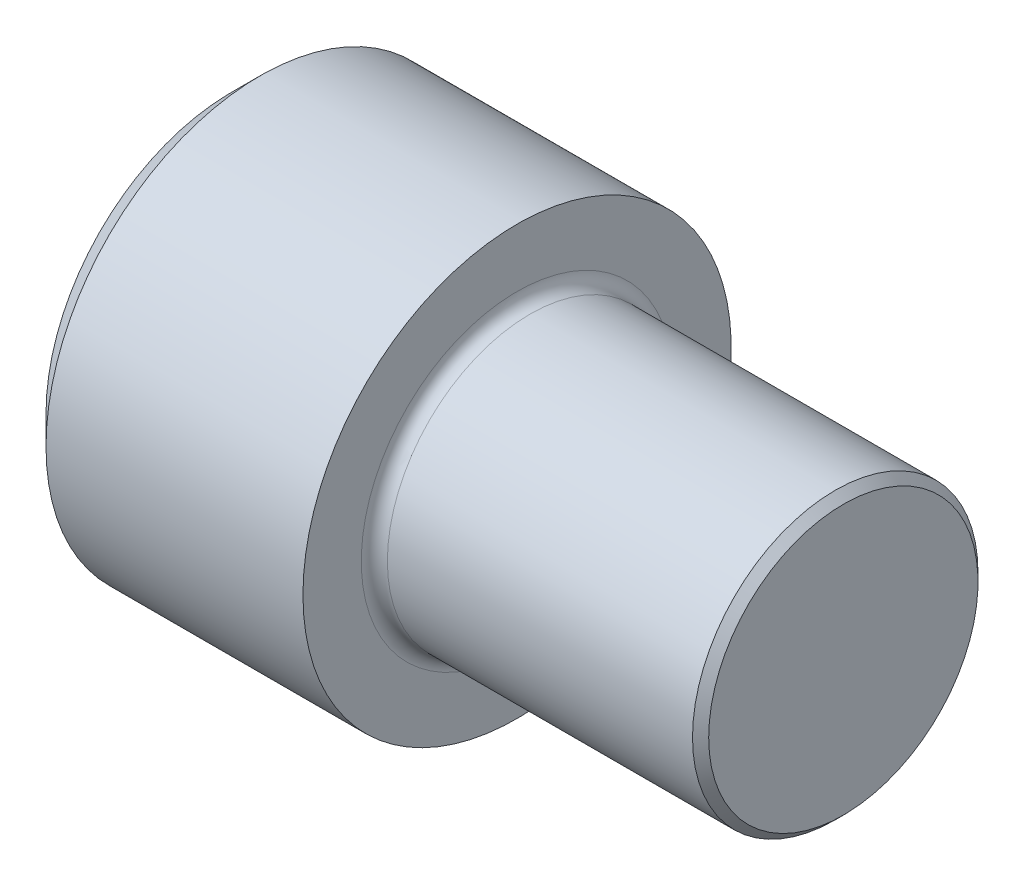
ISO-10303-21;
HEADER;
FILE_DESCRIPTION(('STEP AP214'),'2;1');
FILE_NAME('part.step','',(''),(''),'','','');
FILE_SCHEMA(('AUTOMOTIVE_DESIGN { 1 0 10303 214 1 1 1 1 }'));
ENDSEC;
DATA;
#1=APPLICATION_CONTEXT('core data for automotive mechanical design processes');
#2=APPLICATION_PROTOCOL_DEFINITION('international standard','automotive_design',2000,#1);
#3=PRODUCT_CONTEXT('',#1,'mechanical');
#4=PRODUCT('Part','Part','',(#3));
#5=PRODUCT_RELATED_PRODUCT_CATEGORY('part','',(#4));
#6=PRODUCT_DEFINITION_FORMATION('','',#4);
#7=PRODUCT_DEFINITION_CONTEXT('part definition',#1,'design');
#8=PRODUCT_DEFINITION('design','',#6,#7);
#9=PRODUCT_DEFINITION_SHAPE('','',#8);
#10=(LENGTH_UNIT() NAMED_UNIT(*) SI_UNIT(.MILLI.,.METRE.));
#11=(NAMED_UNIT(*) PLANE_ANGLE_UNIT() SI_UNIT($,.RADIAN.));
#12=(NAMED_UNIT(*) SI_UNIT($,.STERADIAN.) SOLID_ANGLE_UNIT());
#13=UNCERTAINTY_MEASURE_WITH_UNIT(LENGTH_MEASURE(1.E-05),#10,'distance_accuracy_value','');
#14=(GEOMETRIC_REPRESENTATION_CONTEXT(3) GLOBAL_UNCERTAINTY_ASSIGNED_CONTEXT((#13)) GLOBAL_UNIT_ASSIGNED_CONTEXT((#10,
#11,#12)) REPRESENTATION_CONTEXT('',''));
#15=CARTESIAN_POINT('',(0.,0.,0.));
#16=DIRECTION('',(0.,0.,1.));
#17=DIRECTION('',(1.,0.,0.));
#18=AXIS2_PLACEMENT_3D('',#15,#16,#17);
#19=CARTESIAN_POINT('',(0.,0.,0.));
#20=DIRECTION('',(-1.,0.,0.));
#21=DIRECTION('',(0.,0.,1.));
#22=AXIS2_PLACEMENT_3D('',#19,#20,#21);
#23=PLANE('',#22);
#24=DIRECTION('',(0.,-0.499999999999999,0.866025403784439));
#25=VECTOR('',#24,1.);
#26=CARTESIAN_POINT('',(0.,18.3308710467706,0.));
#27=LINE('',#26,#25);
#28=CARTESIAN_POINT('',(0.,18.3308710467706,0.));
#29=VERTEX_POINT('',#28);
#30=CARTESIAN_POINT('',(0.,9.16543552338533,15.875));
#31=VERTEX_POINT('',#30);
#32=EDGE_CURVE('E264',#29,#31,#27,.T.);
#33=ORIENTED_EDGE('',*,*,#32,.T.);
#34=DIRECTION('',(0.,1.,0.));
#35=VECTOR('',#34,1.);
#36=CARTESIAN_POINT('',(0.,-9.16543552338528,15.875));
#37=LINE('',#36,#35);
#38=CARTESIAN_POINT('',(0.,-9.16543552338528,15.875));
#39=VERTEX_POINT('',#38);
#40=EDGE_CURVE('E132',#39,#31,#37,.T.);
#41=ORIENTED_EDGE('',*,*,#40,.F.);
#42=DIRECTION('',(0.,-0.500000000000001,-0.866025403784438));
#43=VECTOR('',#42,1.);
#44=CARTESIAN_POINT('',(0.,-9.16543552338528,15.875));
#45=LINE('',#44,#43);
#46=CARTESIAN_POINT('',(0.,-18.3308710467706,0.));
#47=VERTEX_POINT('',#46);
#48=EDGE_CURVE('E269',#39,#47,#45,.T.);
#49=ORIENTED_EDGE('',*,*,#48,.T.);
#50=DIRECTION('',(0.,0.499999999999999,-0.86602540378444));
#51=VECTOR('',#50,1.);
#52=CARTESIAN_POINT('',(0.,-18.3308710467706,0.));
#53=LINE('',#52,#51);
#54=CARTESIAN_POINT('',(0.,-9.16543552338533,-15.875));
#55=VERTEX_POINT('',#54);
#56=EDGE_CURVE('E266',#47,#55,#53,.T.);
#57=ORIENTED_EDGE('',*,*,#56,.T.);
#58=DIRECTION('',(0.,-1.,0.));
#59=VECTOR('',#58,1.);
#60=CARTESIAN_POINT('',(0.,9.16543552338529,-15.875));
#61=LINE('',#60,#59);
#62=CARTESIAN_POINT('',(0.,9.16543552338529,-15.875));
#63=VERTEX_POINT('',#62);
#64=EDGE_CURVE('E271',#63,#55,#61,.T.);
#65=ORIENTED_EDGE('',*,*,#64,.F.);
#66=DIRECTION('',(0.,-0.500000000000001,-0.866025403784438));
#67=VECTOR('',#66,1.);
#68=CARTESIAN_POINT('',(0.,18.3308710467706,0.));
#69=LINE('',#68,#67);
#70=EDGE_CURVE('E128',#29,#63,#69,.T.);
#71=ORIENTED_EDGE('',*,*,#70,.F.);
#72=EDGE_LOOP('',(#33,#41,#49,#57,#65,#71));
#73=FACE_BOUND('',#72,.T.);
#74=CARTESIAN_POINT('',(0.,0.,0.));
#75=DIRECTION('',(-1.,0.,0.));
#76=DIRECTION('',(0.,0.,1.));
#77=AXIS2_PLACEMENT_3D('',#74,#75,#76);
#78=CIRCLE('',#77,28.8925);
#79=CARTESIAN_POINT('',(0.,0.,28.8925));
#80=VERTEX_POINT('',#79);
#81=EDGE_CURVE('E160',#80,#80,#78,.T.);
#82=ORIENTED_EDGE('',*,*,#81,.T.);
#83=EDGE_LOOP('',(#82));
#84=FACE_BOUND('',#83,.T.);
#85=ADVANCED_FACE('F39',(#73,#84),#23,.T.);
#86=CARTESIAN_POINT('',(0.,0.,0.));
#87=DIRECTION('',(1.,0.,0.));
#88=DIRECTION('',(0.,0.,-1.));
#89=AXIS2_PLACEMENT_3D('',#86,#87,#88);
#90=CONICAL_SURFACE('',#89,28.8925,0.785398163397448);
#91=CARTESIAN_POINT('',(4.44499999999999,0.,0.));
#92=DIRECTION('',(-1.,0.,0.));
#93=DIRECTION('',(0.,0.,1.));
#94=AXIS2_PLACEMENT_3D('',#91,#92,#93);
#95=CIRCLE('',#94,33.3375);
#96=CARTESIAN_POINT('',(4.44499999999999,0.,33.3375));
#97=VERTEX_POINT('',#96);
#98=EDGE_CURVE('E158',#97,#97,#95,.T.);
#99=ORIENTED_EDGE('',*,*,#98,.T.);
#100=EDGE_LOOP('',(#99));
#101=FACE_BOUND('',#100,.T.);
#102=ORIENTED_EDGE('',*,*,#81,.F.);
#103=EDGE_LOOP('',(#102));
#104=FACE_BOUND('',#103,.T.);
#105=ADVANCED_FACE('F181',(#101,#104),#90,.T.);
#106=CARTESIAN_POINT('',(-31.75,0.,0.));
#107=DIRECTION('',(-1.,0.,0.));
#108=DIRECTION('',(0.,0.,1.));
#109=AXIS2_PLACEMENT_3D('',#106,#107,#108);
#110=CYLINDRICAL_SURFACE('',#109,33.3375);
#111=CARTESIAN_POINT('',(44.45,0.,0.));
#112=DIRECTION('',(-1.,0.,0.));
#113=DIRECTION('',(0.,0.,1.));
#114=AXIS2_PLACEMENT_3D('',#111,#112,#113);
#115=CIRCLE('',#114,33.3375);
#116=CARTESIAN_POINT('',(44.45,0.,33.3375));
#117=VERTEX_POINT('',#116);
#118=EDGE_CURVE('E151',#117,#117,#115,.T.);
#119=ORIENTED_EDGE('',*,*,#118,.T.);
#120=EDGE_LOOP('',(#119));
#121=FACE_BOUND('',#120,.T.);
#122=ORIENTED_EDGE('',*,*,#98,.F.);
#123=EDGE_LOOP('',(#122));
#124=FACE_BOUND('',#123,.T.);
#125=ADVANCED_FACE('F187',(#121,#124),#110,.T.);
#126=CARTESIAN_POINT('',(44.45,33.3375,0.));
#127=DIRECTION('',(1.,0.,0.));
#128=DIRECTION('',(0.,0.,-1.));
#129=AXIS2_PLACEMENT_3D('',#126,#127,#128);
#130=PLANE('',#129);
#131=CARTESIAN_POINT('',(44.45,0.,0.));
#132=DIRECTION('',(1.,0.,0.));
#133=DIRECTION('',(0.,0.,-1.));
#134=AXIS2_PLACEMENT_3D('',#131,#132,#133);
#135=CIRCLE('',#134,24.2570000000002);
#136=CARTESIAN_POINT('',(44.45,0.,-24.2570000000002));
#137=VERTEX_POINT('',#136);
#138=EDGE_CURVE('E50',#137,#137,#135,.F.);
#139=ORIENTED_EDGE('',*,*,#138,.T.);
#140=EDGE_LOOP('',(#139));
#141=FACE_BOUND('',#140,.T.);
#142=ORIENTED_EDGE('',*,*,#118,.F.);
#143=EDGE_LOOP('',(#142));
#144=FACE_BOUND('',#143,.T.);
#145=ADVANCED_FACE('F165',(#141,#144),#130,.T.);
#146=CARTESIAN_POINT('',(-31.75,0.,0.));
#147=DIRECTION('',(-1.,0.,0.));
#148=DIRECTION('',(0.,0.,1.));
#149=AXIS2_PLACEMENT_3D('',#146,#147,#148);
#150=CYLINDRICAL_SURFACE('',#149,22.2250000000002);
#151=CARTESIAN_POINT('',(46.482,0.,0.));
#152=DIRECTION('',(1.,0.,0.));
#153=DIRECTION('',(0.,0.,-1.));
#154=AXIS2_PLACEMENT_3D('',#151,#152,#153);
#155=CIRCLE('',#154,22.2250000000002);
#156=CARTESIAN_POINT('',(46.482,0.,-22.2250000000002));
#157=VERTEX_POINT('',#156);
#158=EDGE_CURVE('E11',#157,#157,#155,.T.);
#159=ORIENTED_EDGE('',*,*,#158,.T.);
#160=EDGE_LOOP('',(#159));
#161=FACE_BOUND('',#160,.T.);
#162=CARTESIAN_POINT('',(93.9901600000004,0.,0.));
#163=DIRECTION('',(-1.,0.,0.));
#164=DIRECTION('',(0.,0.,1.));
#165=AXIS2_PLACEMENT_3D('',#162,#163,#164);
#166=CIRCLE('',#165,22.2250000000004);
#167=CARTESIAN_POINT('',(93.9901600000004,0.,22.2250000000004));
#168=VERTEX_POINT('',#167);
#169=EDGE_CURVE('E148',#168,#168,#166,.T.);
#170=ORIENTED_EDGE('',*,*,#169,.T.);
#171=EDGE_LOOP('',(#170));
#172=FACE_BOUND('',#171,.T.);
#173=ADVANCED_FACE('F198',(#161,#172),#150,.T.);
#174=CARTESIAN_POINT('',(95.25,0.,0.));
#175=DIRECTION('',(-1.,0.,0.));
#176=DIRECTION('',(0.,0.,1.));
#177=AXIS2_PLACEMENT_3D('',#174,#175,#176);
#178=CONICAL_SURFACE('',#177,20.96516,0.785398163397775);
#179=ORIENTED_EDGE('',*,*,#169,.F.);
#180=EDGE_LOOP('',(#179));
#181=FACE_BOUND('',#180,.T.);
#182=CARTESIAN_POINT('',(95.25,0.,0.));
#183=DIRECTION('',(-1.,0.,0.));
#184=DIRECTION('',(0.,0.,1.));
#185=AXIS2_PLACEMENT_3D('',#182,#183,#184);
#186=CIRCLE('',#185,20.96516);
#187=CARTESIAN_POINT('',(95.25,0.,20.96516));
#188=VERTEX_POINT('',#187);
#189=EDGE_CURVE('E147',#188,#188,#186,.T.);
#190=ORIENTED_EDGE('',*,*,#189,.T.);
#191=EDGE_LOOP('',(#190));
#192=FACE_BOUND('',#191,.T.);
#193=ADVANCED_FACE('F180',(#181,#192),#178,.T.);
#194=CARTESIAN_POINT('',(95.25,20.96516,0.));
#195=DIRECTION('',(1.,0.,0.));
#196=DIRECTION('',(0.,0.,-1.));
#197=AXIS2_PLACEMENT_3D('',#194,#195,#196);
#198=PLANE('',#197);
#199=ORIENTED_EDGE('',*,*,#189,.F.);
#200=EDGE_LOOP('',(#199));
#201=FACE_BOUND('',#200,.T.);
#202=ADVANCED_FACE('F166',(#201),#198,.T.);
#203=CARTESIAN_POINT('',(46.482,0.,0.));
#204=DIRECTION('',(1.,0.,0.));
#205=DIRECTION('',(0.,0.,-1.));
#206=AXIS2_PLACEMENT_3D('',#203,#204,#205);
#207=TOROIDAL_SURFACE('',#206,24.2570000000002,2.032);
#208=ORIENTED_EDGE('',*,*,#158,.F.);
#209=EDGE_LOOP('',(#208));
#210=FACE_BOUND('',#209,.T.);
#211=ORIENTED_EDGE('',*,*,#138,.F.);
#212=EDGE_LOOP('',(#211));
#213=FACE_BOUND('',#212,.T.);
#214=ADVANCED_FACE('F41',(#210,#213),#207,.F.);
#215=CARTESIAN_POINT('',(22.098,18.3308710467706,0.));
#216=DIRECTION('',(0.,-0.866025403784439,-0.499999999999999));
#217=DIRECTION('',(0.,0.499999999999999,-0.866025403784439));
#218=AXIS2_PLACEMENT_3D('',#215,#216,#217);
#219=PLANE('',#218);
#220=ORIENTED_EDGE('',*,*,#32,.F.);
#221=DIRECTION('',(-1.,0.,0.));
#222=VECTOR('',#221,1.);
#223=CARTESIAN_POINT('',(22.098,18.3308710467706,0.));
#224=LINE('',#223,#222);
#225=CARTESIAN_POINT('',(22.098,18.3308710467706,0.));
#226=VERTEX_POINT('',#225);
#227=EDGE_CURVE('E251',#226,#29,#224,.T.);
#228=ORIENTED_EDGE('',*,*,#227,.F.);
#229=DIRECTION('',(0.,-0.499999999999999,0.866025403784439));
#230=VECTOR('',#229,1.);
#231=CARTESIAN_POINT('',(22.098,18.3308710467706,0.));
#232=LINE('',#231,#230);
#233=CARTESIAN_POINT('',(22.098,13.748153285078,7.93749999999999));
#234=VERTEX_POINT('',#233);
#235=EDGE_CURVE('E125',#226,#234,#232,.T.);
#236=ORIENTED_EDGE('',*,*,#235,.T.);
#237=CARTESIAN_POINT('',(22.098,9.16543552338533,15.875));
#238=VERTEX_POINT('',#237);
#239=EDGE_CURVE('E113',#234,#238,#232,.T.);
#240=ORIENTED_EDGE('',*,*,#239,.T.);
#241=DIRECTION('',(-1.,0.,0.));
#242=VECTOR('',#241,1.);
#243=CARTESIAN_POINT('',(22.098,9.16543552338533,15.875));
#244=LINE('',#243,#242);
#245=EDGE_CURVE('E129',#238,#31,#244,.T.);
#246=ORIENTED_EDGE('',*,*,#245,.T.);
#247=EDGE_LOOP('',(#220,#228,#236,#240,#246));
#248=FACE_BOUND('',#247,.T.);
#249=ADVANCED_FACE('F127',(#248),#219,.T.);
#250=CARTESIAN_POINT('',(22.098,-9.16543552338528,15.875));
#251=DIRECTION('',(0.,0.,1.));
#252=DIRECTION('',(0.,-1.,0.));
#253=AXIS2_PLACEMENT_3D('',#250,#251,#252);
#254=PLANE('',#253);
#255=ORIENTED_EDGE('',*,*,#40,.T.);
#256=ORIENTED_EDGE('',*,*,#245,.F.);
#257=DIRECTION('',(0.,1.,0.));
#258=VECTOR('',#257,1.);
#259=CARTESIAN_POINT('',(22.098,-9.16543552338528,15.875));
#260=LINE('',#259,#258);
#261=CARTESIAN_POINT('',(22.098,0.,15.875));
#262=VERTEX_POINT('',#261);
#263=EDGE_CURVE('E109',#262,#238,#260,.T.);
#264=ORIENTED_EDGE('',*,*,#263,.F.);
#265=CARTESIAN_POINT('',(22.098,-9.16543552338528,15.875));
#266=VERTEX_POINT('',#265);
#267=EDGE_CURVE('E122',#266,#262,#260,.T.);
#268=ORIENTED_EDGE('',*,*,#267,.F.);
#269=DIRECTION('',(-1.,0.,0.));
#270=VECTOR('',#269,1.);
#271=CARTESIAN_POINT('',(22.098,-9.16543552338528,15.875));
#272=LINE('',#271,#270);
#273=EDGE_CURVE('E139',#266,#39,#272,.T.);
#274=ORIENTED_EDGE('',*,*,#273,.T.);
#275=EDGE_LOOP('',(#255,#256,#264,#268,#274));
#276=FACE_BOUND('',#275,.T.);
#277=ADVANCED_FACE('F135',(#276),#254,.F.);
#278=CARTESIAN_POINT('',(22.098,-9.16543552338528,15.875));
#279=DIRECTION('',(0.,0.866025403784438,-0.500000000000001));
#280=DIRECTION('',(0.,0.500000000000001,0.866025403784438));
#281=AXIS2_PLACEMENT_3D('',#278,#279,#280);
#282=PLANE('',#281);
#283=ORIENTED_EDGE('',*,*,#48,.F.);
#284=ORIENTED_EDGE('',*,*,#273,.F.);
#285=DIRECTION('',(0.,-0.500000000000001,-0.866025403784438));
#286=VECTOR('',#285,1.);
#287=CARTESIAN_POINT('',(22.098,-9.16543552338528,15.875));
#288=LINE('',#287,#286);
#289=CARTESIAN_POINT('',(22.098,-13.7481532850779,7.93750000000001));
#290=VERTEX_POINT('',#289);
#291=EDGE_CURVE('E291',#266,#290,#288,.T.);
#292=ORIENTED_EDGE('',*,*,#291,.T.);
#293=CARTESIAN_POINT('',(22.098,-18.3308710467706,0.));
#294=VERTEX_POINT('',#293);
#295=EDGE_CURVE('E285',#290,#294,#288,.T.);
#296=ORIENTED_EDGE('',*,*,#295,.T.);
#297=DIRECTION('',(-1.,0.,0.));
#298=VECTOR('',#297,1.);
#299=CARTESIAN_POINT('',(22.098,-18.3308710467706,0.));
#300=LINE('',#299,#298);
#301=EDGE_CURVE('E145',#294,#47,#300,.T.);
#302=ORIENTED_EDGE('',*,*,#301,.T.);
#303=EDGE_LOOP('',(#283,#284,#292,#296,#302));
#304=FACE_BOUND('',#303,.T.);
#305=ADVANCED_FACE('F206',(#304),#282,.T.);
#306=CARTESIAN_POINT('',(22.098,-18.3308710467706,0.));
#307=DIRECTION('',(0.,0.866025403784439,0.499999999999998));
#308=DIRECTION('',(0.,-0.499999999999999,0.86602540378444));
#309=AXIS2_PLACEMENT_3D('',#306,#307,#308);
#310=PLANE('',#309);
#311=ORIENTED_EDGE('',*,*,#56,.F.);
#312=ORIENTED_EDGE('',*,*,#301,.F.);
#313=DIRECTION('',(0.,0.499999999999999,-0.86602540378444));
#314=VECTOR('',#313,1.);
#315=CARTESIAN_POINT('',(22.098,-18.3308710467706,0.));
#316=LINE('',#315,#314);
#317=CARTESIAN_POINT('',(22.098,-13.748153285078,-7.93749999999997));
#318=VERTEX_POINT('',#317);
#319=EDGE_CURVE('E258',#294,#318,#316,.T.);
#320=ORIENTED_EDGE('',*,*,#319,.T.);
#321=CARTESIAN_POINT('',(22.098,-9.16543552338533,-15.875));
#322=VERTEX_POINT('',#321);
#323=EDGE_CURVE('E292',#318,#322,#316,.T.);
#324=ORIENTED_EDGE('',*,*,#323,.T.);
#325=DIRECTION('',(-1.,0.,0.));
#326=VECTOR('',#325,1.);
#327=CARTESIAN_POINT('',(22.098,-9.16543552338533,-15.875));
#328=LINE('',#327,#326);
#329=EDGE_CURVE('E254',#322,#55,#328,.T.);
#330=ORIENTED_EDGE('',*,*,#329,.T.);
#331=EDGE_LOOP('',(#311,#312,#320,#324,#330));
#332=FACE_BOUND('',#331,.T.);
#333=ADVANCED_FACE('F212',(#332),#310,.T.);
#334=CARTESIAN_POINT('',(22.098,9.16543552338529,-15.875));
#335=DIRECTION('',(0.,0.,-1.));
#336=DIRECTION('',(0.,1.,0.));
#337=AXIS2_PLACEMENT_3D('',#334,#335,#336);
#338=PLANE('',#337);
#339=ORIENTED_EDGE('',*,*,#64,.T.);
#340=ORIENTED_EDGE('',*,*,#329,.F.);
#341=DIRECTION('',(0.,-1.,0.));
#342=VECTOR('',#341,1.);
#343=CARTESIAN_POINT('',(22.098,9.16543552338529,-15.875));
#344=LINE('',#343,#342);
#345=CARTESIAN_POINT('',(22.098,0.,-15.875));
#346=VERTEX_POINT('',#345);
#347=EDGE_CURVE('E259',#346,#322,#344,.T.);
#348=ORIENTED_EDGE('',*,*,#347,.F.);
#349=CARTESIAN_POINT('',(22.098,9.16543552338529,-15.875));
#350=VERTEX_POINT('',#349);
#351=EDGE_CURVE('E53',#350,#346,#344,.T.);
#352=ORIENTED_EDGE('',*,*,#351,.F.);
#353=DIRECTION('',(-1.,0.,0.));
#354=VECTOR('',#353,1.);
#355=CARTESIAN_POINT('',(22.098,9.16543552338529,-15.875));
#356=LINE('',#355,#354);
#357=EDGE_CURVE('E249',#350,#63,#356,.T.);
#358=ORIENTED_EDGE('',*,*,#357,.T.);
#359=EDGE_LOOP('',(#339,#340,#348,#352,#358));
#360=FACE_BOUND('',#359,.T.);
#361=ADVANCED_FACE('F213',(#360),#338,.F.);
#362=CARTESIAN_POINT('',(22.098,18.3308710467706,0.));
#363=DIRECTION('',(0.,0.866025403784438,-0.500000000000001));
#364=DIRECTION('',(0.,0.500000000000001,0.866025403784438));
#365=AXIS2_PLACEMENT_3D('',#362,#363,#364);
#366=PLANE('',#365);
#367=ORIENTED_EDGE('',*,*,#70,.T.);
#368=ORIENTED_EDGE('',*,*,#357,.F.);
#369=DIRECTION('',(0.,-0.500000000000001,-0.866025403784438));
#370=VECTOR('',#369,1.);
#371=CARTESIAN_POINT('',(22.098,18.3308710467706,0.));
#372=LINE('',#371,#370);
#373=CARTESIAN_POINT('',(22.098,13.748153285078,-7.93750000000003));
#374=VERTEX_POINT('',#373);
#375=EDGE_CURVE('E239',#374,#350,#372,.T.);
#376=ORIENTED_EDGE('',*,*,#375,.F.);
#377=EDGE_CURVE('E246',#226,#374,#372,.T.);
#378=ORIENTED_EDGE('',*,*,#377,.F.);
#379=ORIENTED_EDGE('',*,*,#227,.T.);
#380=EDGE_LOOP('',(#367,#368,#376,#378,#379));
#381=FACE_BOUND('',#380,.T.);
#382=ADVANCED_FACE('F219',(#381),#366,.F.);
#383=CARTESIAN_POINT('',(22.098,18.3308710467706,0.));
#384=DIRECTION('',(1.,0.,0.));
#385=DIRECTION('',(0.,0.,-1.));
#386=AXIS2_PLACEMENT_3D('',#383,#384,#385);
#387=PLANE('',#386);
#388=ORIENTED_EDGE('',*,*,#347,.T.);
#389=ORIENTED_EDGE('',*,*,#323,.F.);
#390=CARTESIAN_POINT('',(22.098,0.,0.));
#391=DIRECTION('',(-1.,0.,0.));
#392=DIRECTION('',(0.,0.,1.));
#393=AXIS2_PLACEMENT_3D('',#390,#391,#392);
#394=CIRCLE('',#393,15.875);
#395=EDGE_CURVE('E287',#346,#318,#394,.T.);
#396=ORIENTED_EDGE('',*,*,#395,.F.);
#397=EDGE_LOOP('',(#388,#389,#396));
#398=FACE_BOUND('',#397,.T.);
#399=ADVANCED_FACE('F222',(#398),#387,.F.);
#400=ORIENTED_EDGE('',*,*,#319,.F.);
#401=ORIENTED_EDGE('',*,*,#295,.F.);
#402=EDGE_CURVE('E136',#318,#290,#394,.T.);
#403=ORIENTED_EDGE('',*,*,#402,.F.);
#404=EDGE_LOOP('',(#400,#401,#403));
#405=FACE_BOUND('',#404,.T.);
#406=ADVANCED_FACE('F228',(#405),#387,.F.);
#407=ORIENTED_EDGE('',*,*,#291,.F.);
#408=ORIENTED_EDGE('',*,*,#267,.T.);
#409=EDGE_CURVE('E138',#290,#262,#394,.T.);
#410=ORIENTED_EDGE('',*,*,#409,.F.);
#411=EDGE_LOOP('',(#407,#408,#410));
#412=FACE_BOUND('',#411,.T.);
#413=ADVANCED_FACE('F233',(#412),#387,.F.);
#414=ORIENTED_EDGE('',*,*,#263,.T.);
#415=ORIENTED_EDGE('',*,*,#239,.F.);
#416=EDGE_CURVE('E116',#262,#234,#394,.T.);
#417=ORIENTED_EDGE('',*,*,#416,.F.);
#418=EDGE_LOOP('',(#414,#415,#417));
#419=FACE_BOUND('',#418,.T.);
#420=ADVANCED_FACE('F115',(#419),#387,.F.);
#421=ORIENTED_EDGE('',*,*,#235,.F.);
#422=ORIENTED_EDGE('',*,*,#377,.T.);
#423=EDGE_CURVE('E149',#234,#374,#394,.T.);
#424=ORIENTED_EDGE('',*,*,#423,.F.);
#425=EDGE_LOOP('',(#421,#422,#424));
#426=FACE_BOUND('',#425,.T.);
#427=ADVANCED_FACE('F234',(#426),#387,.F.);
#428=ORIENTED_EDGE('',*,*,#375,.T.);
#429=ORIENTED_EDGE('',*,*,#351,.T.);
#430=EDGE_CURVE('E243',#374,#346,#394,.T.);
#431=ORIENTED_EDGE('',*,*,#430,.F.);
#432=EDGE_LOOP('',(#428,#429,#431));
#433=FACE_BOUND('',#432,.T.);
#434=ADVANCED_FACE('F205',(#433),#387,.F.);
#435=CARTESIAN_POINT('',(22.098,0.,0.));
#436=DIRECTION('',(-1.,0.,0.));
#437=DIRECTION('',(0.,0.,1.));
#438=AXIS2_PLACEMENT_3D('',#435,#436,#437);
#439=CONICAL_SURFACE('',#438,15.875,1.04719755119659);
#440=CARTESIAN_POINT('',(31.2634355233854,0.,0.));
#441=VERTEX_POINT('',#440);
#442=VERTEX_LOOP('',#441);
#443=FACE_BOUND('',#442,.T.);
#444=ORIENTED_EDGE('',*,*,#416,.T.);
#445=ORIENTED_EDGE('',*,*,#423,.T.);
#446=ORIENTED_EDGE('',*,*,#430,.T.);
#447=ORIENTED_EDGE('',*,*,#395,.T.);
#448=ORIENTED_EDGE('',*,*,#402,.T.);
#449=ORIENTED_EDGE('',*,*,#409,.T.);
#450=EDGE_LOOP('',(#444,#445,#446,#447,#448,#449));
#451=FACE_BOUND('',#450,.T.);
#452=ADVANCED_FACE('F204',(#443,#451),#439,.F.);
#453=CLOSED_SHELL('',(#85,#105,#125,#145,#173,#193,#202,#214,#249,#277,#305,#333,#361,#382,#399,
#406,#413,#420,#427,#434,#452));
#454=MANIFOLD_SOLID_BREP('B2',#453);
#455=ADVANCED_BREP_SHAPE_REPRESENTATION('',(#18,#454),#14);
#456=SHAPE_DEFINITION_REPRESENTATION(#9,#455);
ENDSEC;
END-ISO-10303-21;
